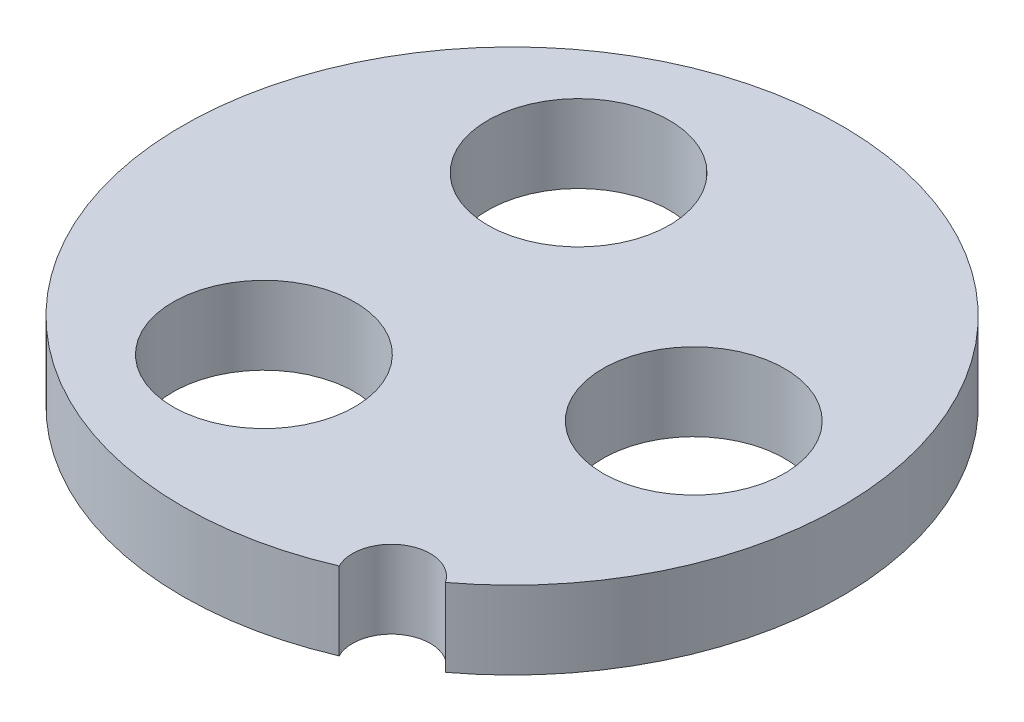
from build123d import *

# Parameters (mm, degrees)
ESQUISSE1_R             = 6.35
ESQUISSE1_R_2           = 1.75
EXTRUSION1_DEPTH        = 1.5
ESQUISSE2_R             = 0.75
ENL_V_MAT_EXTRU_1_DEPTH = 10.104669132


with BuildPart() as part:
    # Esquisse1 → Extrusion1 (new body)
    with BuildSketch(Plane(origin=(0, 0, 0), x_dir=(1, 0, 0), z_dir=(0, 1, 0))):
        with Locations(Location((0, 0, 0), (0, 0, 270))):
            Circle(ESQUISSE1_R)
        with Locations(Location((3.5, 0, 0), (0, 0, 270))):
            Circle(ESQUISSE1_R_2, mode=Mode.SUBTRACT)
        with Locations(Location((-1.75, -3.031088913, 0), (0, 0, 270))):
            Circle(ESQUISSE1_R_2, mode=Mode.SUBTRACT)
        with Locations(Location((-1.75, 3.031088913, 0), (0, 0, 270))):
            Circle(ESQUISSE1_R_2, mode=Mode.SUBTRACT)
    extrude(amount=EXTRUSION1_DEPTH)

    # Esquisse2 → Enl_v. mat.-Extru.1 (cut, through all)
    with BuildSketch(Plane.XZ):
        with Locations((3.175, 5.499261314)):
            Circle(ESQUISSE2_R)
    extrude(amount=-ENL_V_MAT_EXTRU_1_DEPTH, mode=Mode.SUBTRACT)


solid = part.part
